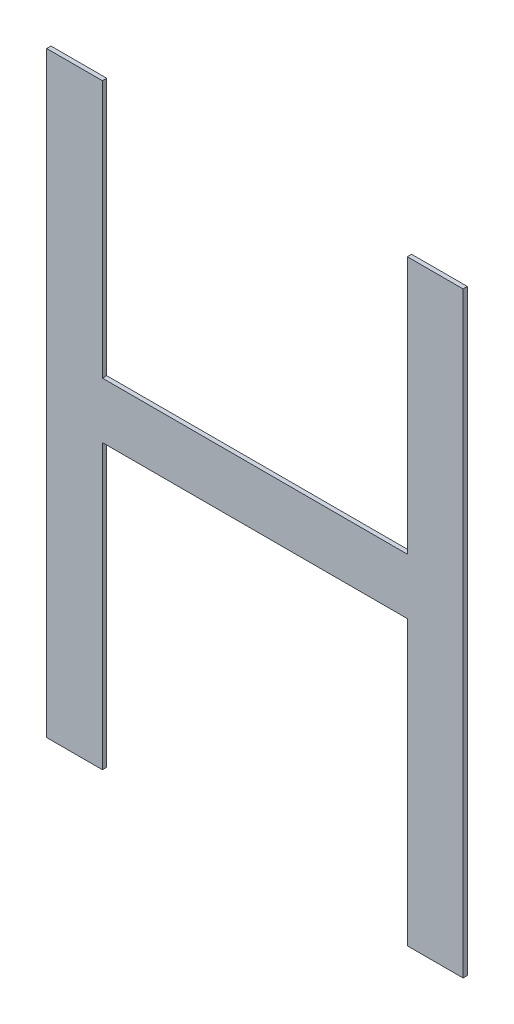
ISO-10303-21;
HEADER;
FILE_DESCRIPTION(('STEP AP214'),'2;1');
FILE_NAME('part.step','',(''),(''),'','','');
FILE_SCHEMA(('AUTOMOTIVE_DESIGN { 1 0 10303 214 1 1 1 1 }'));
ENDSEC;
DATA;
#1=APPLICATION_CONTEXT('core data for automotive mechanical design processes');
#2=APPLICATION_PROTOCOL_DEFINITION('international standard','automotive_design',2000,#1);
#3=PRODUCT_CONTEXT('',#1,'mechanical');
#4=PRODUCT('Part','Part','',(#3));
#5=PRODUCT_RELATED_PRODUCT_CATEGORY('part','',(#4));
#6=PRODUCT_DEFINITION_FORMATION('','',#4);
#7=PRODUCT_DEFINITION_CONTEXT('part definition',#1,'design');
#8=PRODUCT_DEFINITION('design','',#6,#7);
#9=PRODUCT_DEFINITION_SHAPE('','',#8);
#10=(LENGTH_UNIT() NAMED_UNIT(*) SI_UNIT(.MILLI.,.METRE.));
#11=(NAMED_UNIT(*) PLANE_ANGLE_UNIT() SI_UNIT($,.RADIAN.));
#12=(NAMED_UNIT(*) SI_UNIT($,.STERADIAN.) SOLID_ANGLE_UNIT());
#13=UNCERTAINTY_MEASURE_WITH_UNIT(LENGTH_MEASURE(1.E-05),#10,'distance_accuracy_value','');
#14=(GEOMETRIC_REPRESENTATION_CONTEXT(3) GLOBAL_UNCERTAINTY_ASSIGNED_CONTEXT((#13)) GLOBAL_UNIT_ASSIGNED_CONTEXT((#10,
#11,#12)) REPRESENTATION_CONTEXT('',''));
#15=CARTESIAN_POINT('',(0.,0.,0.));
#16=DIRECTION('',(0.,0.,1.));
#17=DIRECTION('',(1.,0.,0.));
#18=AXIS2_PLACEMENT_3D('',#15,#16,#17);
#19=CARTESIAN_POINT('',(-0.48499776,-0.69499988,0.01));
#20=DIRECTION('',(0.,0.,-1.));
#21=DIRECTION('',(-1.,0.,0.));
#22=AXIS2_PLACEMENT_3D('',#19,#20,#21);
#23=PLANE('',#22);
#24=DIRECTION('',(0.,1.,0.));
#25=VECTOR('',#24,1.);
#26=CARTESIAN_POINT('',(-0.35499802,-0.69499988,0.01));
#27=LINE('',#26,#25);
#28=CARTESIAN_POINT('',(-0.35499802,-0.03500120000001,0.01));
#29=VERTEX_POINT('',#28);
#30=CARTESIAN_POINT('',(-0.35499802,-0.69499988,0.01));
#31=VERTEX_POINT('',#30);
#32=EDGE_CURVE('E20',#29,#31,#27,.F.);
#33=ORIENTED_EDGE('',*,*,#32,.F.);
#34=DIRECTION('',(1.,0.,0.));
#35=VECTOR('',#34,1.);
#36=CARTESIAN_POINT('',(-0.35499802,-0.03500120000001,0.01));
#37=LINE('',#36,#35);
#38=CARTESIAN_POINT('',(0.35500056,-0.03500120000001,0.01));
#39=VERTEX_POINT('',#38);
#40=EDGE_CURVE('E154',#29,#39,#37,.T.);
#41=ORIENTED_EDGE('',*,*,#40,.T.);
#42=DIRECTION('',(0.,1.,0.));
#43=VECTOR('',#42,1.);
#44=CARTESIAN_POINT('',(0.35500056,-0.03500120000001,0.01));
#45=LINE('',#44,#43);
#46=CARTESIAN_POINT('',(0.35500056,-0.69499988,0.01));
#47=VERTEX_POINT('',#46);
#48=EDGE_CURVE('E150',#39,#47,#45,.F.);
#49=ORIENTED_EDGE('',*,*,#48,.T.);
#50=DIRECTION('',(1.,0.,0.));
#51=VECTOR('',#50,1.);
#52=CARTESIAN_POINT('',(0.35500056,-0.69499988,0.01));
#53=LINE('',#52,#51);
#54=CARTESIAN_POINT('',(0.4850003,-0.69499988,0.01));
#55=VERTEX_POINT('',#54);
#56=EDGE_CURVE('E146',#47,#55,#53,.T.);
#57=ORIENTED_EDGE('',*,*,#56,.T.);
#58=DIRECTION('',(0.,1.,0.));
#59=VECTOR('',#58,1.);
#60=CARTESIAN_POINT('',(0.4850003,-0.69499988,0.01));
#61=LINE('',#60,#59);
#62=CARTESIAN_POINT('',(0.4850003,0.69499988,0.01));
#63=VERTEX_POINT('',#62);
#64=EDGE_CURVE('E142',#55,#63,#61,.T.);
#65=ORIENTED_EDGE('',*,*,#64,.T.);
#66=DIRECTION('',(1.,0.,0.));
#67=VECTOR('',#66,1.);
#68=CARTESIAN_POINT('',(0.4850003,0.69499988,0.01));
#69=LINE('',#68,#67);
#70=CARTESIAN_POINT('',(0.35500056,0.69499988,0.01));
#71=VERTEX_POINT('',#70);
#72=EDGE_CURVE('E138',#63,#71,#69,.F.);
#73=ORIENTED_EDGE('',*,*,#72,.T.);
#74=DIRECTION('',(0.,1.,0.));
#75=VECTOR('',#74,1.);
#76=CARTESIAN_POINT('',(0.35500056,0.69499988,0.01));
#77=LINE('',#76,#75);
#78=CARTESIAN_POINT('',(0.35500056,0.09499853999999,0.01));
#79=VERTEX_POINT('',#78);
#80=EDGE_CURVE('E134',#71,#79,#77,.F.);
#81=ORIENTED_EDGE('',*,*,#80,.T.);
#82=DIRECTION('',(1.,0.,0.));
#83=VECTOR('',#82,1.);
#84=CARTESIAN_POINT('',(0.35500056,0.09499853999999,0.01));
#85=LINE('',#84,#83);
#86=CARTESIAN_POINT('',(-0.35499802,0.09499853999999,0.01));
#87=VERTEX_POINT('',#86);
#88=EDGE_CURVE('E130',#79,#87,#85,.F.);
#89=ORIENTED_EDGE('',*,*,#88,.T.);
#90=DIRECTION('',(0.,1.,0.));
#91=VECTOR('',#90,1.);
#92=CARTESIAN_POINT('',(-0.35499802,0.09499853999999,0.01));
#93=LINE('',#92,#91);
#94=CARTESIAN_POINT('',(-0.35499802,0.69499988,0.01));
#95=VERTEX_POINT('',#94);
#96=EDGE_CURVE('E126',#87,#95,#93,.T.);
#97=ORIENTED_EDGE('',*,*,#96,.T.);
#98=DIRECTION('',(1.,0.,0.));
#99=VECTOR('',#98,1.);
#100=CARTESIAN_POINT('',(-0.35499802,0.69499988,0.01));
#101=LINE('',#100,#99);
#102=CARTESIAN_POINT('',(-0.48499776,0.69499988,0.01));
#103=VERTEX_POINT('',#102);
#104=EDGE_CURVE('E104',#95,#103,#101,.F.);
#105=ORIENTED_EDGE('',*,*,#104,.T.);
#106=DIRECTION('',(0.,1.,0.));
#107=VECTOR('',#106,1.);
#108=CARTESIAN_POINT('',(-0.48499776,0.69499988,0.01));
#109=LINE('',#108,#107);
#110=CARTESIAN_POINT('',(-0.48499776,-0.69499988,0.01));
#111=VERTEX_POINT('',#110);
#112=EDGE_CURVE('E119',#103,#111,#109,.F.);
#113=ORIENTED_EDGE('',*,*,#112,.T.);
#114=DIRECTION('',(-1.,0.,0.));
#115=VECTOR('',#114,1.);
#116=CARTESIAN_POINT('',(-0.48499776,-0.69499988,0.01));
#117=LINE('',#116,#115);
#118=EDGE_CURVE('E111',#31,#111,#117,.T.);
#119=ORIENTED_EDGE('',*,*,#118,.F.);
#120=EDGE_LOOP('',(#33,#41,#49,#57,#65,#73,#81,#89,#97,#105,#113,#119));
#121=FACE_BOUND('',#120,.T.);
#122=ADVANCED_FACE('F17',(#121),#23,.F.);
#123=CARTESIAN_POINT('',(-0.48499776,0.69499988,0.));
#124=DIRECTION('',(1.,0.,0.));
#125=DIRECTION('',(0.,0.,-1.));
#126=AXIS2_PLACEMENT_3D('',#123,#124,#125);
#127=PLANE('',#126);
#128=DIRECTION('',(0.,0.,1.));
#129=VECTOR('',#128,1.);
#130=CARTESIAN_POINT('',(-0.48499776,-0.69499988,0.));
#131=LINE('',#130,#129);
#132=CARTESIAN_POINT('',(-0.48499776,-0.69499988,0.));
#133=VERTEX_POINT('',#132);
#134=EDGE_CURVE('E117',#133,#111,#131,.T.);
#135=ORIENTED_EDGE('',*,*,#134,.T.);
#136=ORIENTED_EDGE('',*,*,#112,.F.);
#137=DIRECTION('',(0.,0.,-1.));
#138=VECTOR('',#137,1.);
#139=CARTESIAN_POINT('',(-0.48499776,0.69499988,0.));
#140=LINE('',#139,#138);
#141=CARTESIAN_POINT('',(-0.48499776,0.69499988,0.));
#142=VERTEX_POINT('',#141);
#143=EDGE_CURVE('E124',#103,#142,#140,.T.);
#144=ORIENTED_EDGE('',*,*,#143,.T.);
#145=DIRECTION('',(0.,1.,0.));
#146=VECTOR('',#145,1.);
#147=CARTESIAN_POINT('',(-0.48499776,-0.69499988,0.));
#148=LINE('',#147,#146);
#149=EDGE_CURVE('E116',#133,#142,#148,.T.);
#150=ORIENTED_EDGE('',*,*,#149,.F.);
#151=EDGE_LOOP('',(#135,#136,#144,#150));
#152=FACE_BOUND('',#151,.T.);
#153=ADVANCED_FACE('F235',(#152),#127,.F.);
#154=CARTESIAN_POINT('',(-0.35499802,0.69499988,0.));
#155=DIRECTION('',(0.,-1.,0.));
#156=DIRECTION('',(0.,0.,-1.));
#157=AXIS2_PLACEMENT_3D('',#154,#155,#156);
#158=PLANE('',#157);
#159=ORIENTED_EDGE('',*,*,#143,.F.);
#160=ORIENTED_EDGE('',*,*,#104,.F.);
#161=DIRECTION('',(0.,0.,1.));
#162=VECTOR('',#161,1.);
#163=CARTESIAN_POINT('',(-0.35499802,0.69499988,0.));
#164=LINE('',#163,#162);
#165=CARTESIAN_POINT('',(-0.35499802,0.69499988,0.));
#166=VERTEX_POINT('',#165);
#167=EDGE_CURVE('E128',#95,#166,#164,.F.);
#168=ORIENTED_EDGE('',*,*,#167,.T.);
#169=DIRECTION('',(-1.,0.,0.));
#170=VECTOR('',#169,1.);
#171=CARTESIAN_POINT('',(-0.48499776,0.69499988,0.));
#172=LINE('',#171,#170);
#173=EDGE_CURVE('E162',#142,#166,#172,.F.);
#174=ORIENTED_EDGE('',*,*,#173,.F.);
#175=EDGE_LOOP('',(#159,#160,#168,#174));
#176=FACE_BOUND('',#175,.T.);
#177=ADVANCED_FACE('F233',(#176),#158,.F.);
#178=CARTESIAN_POINT('',(-0.35499802,0.09499853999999,0.));
#179=DIRECTION('',(-1.,0.,0.));
#180=DIRECTION('',(0.,0.,1.));
#181=AXIS2_PLACEMENT_3D('',#178,#179,#180);
#182=PLANE('',#181);
#183=ORIENTED_EDGE('',*,*,#167,.F.);
#184=ORIENTED_EDGE('',*,*,#96,.F.);
#185=DIRECTION('',(0.,0.,-1.));
#186=VECTOR('',#185,1.);
#187=CARTESIAN_POINT('',(-0.35499802,0.09499853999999,0.));
#188=LINE('',#187,#186);
#189=CARTESIAN_POINT('',(-0.35499802,0.09499853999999,0.));
#190=VERTEX_POINT('',#189);
#191=EDGE_CURVE('E132',#87,#190,#188,.T.);
#192=ORIENTED_EDGE('',*,*,#191,.T.);
#193=DIRECTION('',(0.,1.,0.));
#194=VECTOR('',#193,1.);
#195=CARTESIAN_POINT('',(-0.35499802,-0.69499988,0.));
#196=LINE('',#195,#194);
#197=EDGE_CURVE('E165',#166,#190,#196,.F.);
#198=ORIENTED_EDGE('',*,*,#197,.F.);
#199=EDGE_LOOP('',(#183,#184,#192,#198));
#200=FACE_BOUND('',#199,.T.);
#201=ADVANCED_FACE('F228',(#200),#182,.F.);
#202=CARTESIAN_POINT('',(0.35500056,0.09499853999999,0.));
#203=DIRECTION('',(0.,-1.,0.));
#204=DIRECTION('',(0.,0.,-1.));
#205=AXIS2_PLACEMENT_3D('',#202,#203,#204);
#206=PLANE('',#205);
#207=ORIENTED_EDGE('',*,*,#191,.F.);
#208=ORIENTED_EDGE('',*,*,#88,.F.);
#209=DIRECTION('',(0.,0.,-1.));
#210=VECTOR('',#209,1.);
#211=CARTESIAN_POINT('',(0.35500056,0.09499853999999,0.));
#212=LINE('',#211,#210);
#213=CARTESIAN_POINT('',(0.35500056,0.09499853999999,0.));
#214=VERTEX_POINT('',#213);
#215=EDGE_CURVE('E136',#79,#214,#212,.T.);
#216=ORIENTED_EDGE('',*,*,#215,.T.);
#217=DIRECTION('',(-1.,0.,0.));
#218=VECTOR('',#217,1.);
#219=CARTESIAN_POINT('',(-0.48499776,0.09499853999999,0.));
#220=LINE('',#219,#218);
#221=EDGE_CURVE('E168',#190,#214,#220,.F.);
#222=ORIENTED_EDGE('',*,*,#221,.F.);
#223=EDGE_LOOP('',(#207,#208,#216,#222));
#224=FACE_BOUND('',#223,.T.);
#225=ADVANCED_FACE('F224',(#224),#206,.F.);
#226=CARTESIAN_POINT('',(0.35500056,0.69499988,0.));
#227=DIRECTION('',(1.,0.,0.));
#228=DIRECTION('',(0.,0.,-1.));
#229=AXIS2_PLACEMENT_3D('',#226,#227,#228);
#230=PLANE('',#229);
#231=ORIENTED_EDGE('',*,*,#215,.F.);
#232=ORIENTED_EDGE('',*,*,#80,.F.);
#233=DIRECTION('',(0.,0.,-1.));
#234=VECTOR('',#233,1.);
#235=CARTESIAN_POINT('',(0.35500056,0.69499988,0.));
#236=LINE('',#235,#234);
#237=CARTESIAN_POINT('',(0.35500056,0.69499988,0.));
#238=VERTEX_POINT('',#237);
#239=EDGE_CURVE('E140',#71,#238,#236,.T.);
#240=ORIENTED_EDGE('',*,*,#239,.T.);
#241=DIRECTION('',(0.,1.,0.));
#242=VECTOR('',#241,1.);
#243=CARTESIAN_POINT('',(0.35500056,-0.69499988,0.));
#244=LINE('',#243,#242);
#245=EDGE_CURVE('E171',#214,#238,#244,.T.);
#246=ORIENTED_EDGE('',*,*,#245,.F.);
#247=EDGE_LOOP('',(#231,#232,#240,#246));
#248=FACE_BOUND('',#247,.T.);
#249=ADVANCED_FACE('F219',(#248),#230,.F.);
#250=CARTESIAN_POINT('',(0.4850003,0.69499988,0.));
#251=DIRECTION('',(0.,-1.,0.));
#252=DIRECTION('',(0.,0.,-1.));
#253=AXIS2_PLACEMENT_3D('',#250,#251,#252);
#254=PLANE('',#253);
#255=ORIENTED_EDGE('',*,*,#239,.F.);
#256=ORIENTED_EDGE('',*,*,#72,.F.);
#257=DIRECTION('',(0.,0.,1.));
#258=VECTOR('',#257,1.);
#259=CARTESIAN_POINT('',(0.4850003,0.69499988,0.));
#260=LINE('',#259,#258);
#261=CARTESIAN_POINT('',(0.4850003,0.69499988,0.));
#262=VERTEX_POINT('',#261);
#263=EDGE_CURVE('E144',#63,#262,#260,.F.);
#264=ORIENTED_EDGE('',*,*,#263,.T.);
#265=DIRECTION('',(-1.,0.,0.));
#266=VECTOR('',#265,1.);
#267=CARTESIAN_POINT('',(-0.48499776,0.69499988,0.));
#268=LINE('',#267,#266);
#269=EDGE_CURVE('E174',#238,#262,#268,.F.);
#270=ORIENTED_EDGE('',*,*,#269,.F.);
#271=EDGE_LOOP('',(#255,#256,#264,#270));
#272=FACE_BOUND('',#271,.T.);
#273=ADVANCED_FACE('F214',(#272),#254,.F.);
#274=CARTESIAN_POINT('',(0.4850003,-0.69499988,0.));
#275=DIRECTION('',(-1.,0.,0.));
#276=DIRECTION('',(0.,0.,1.));
#277=AXIS2_PLACEMENT_3D('',#274,#275,#276);
#278=PLANE('',#277);
#279=ORIENTED_EDGE('',*,*,#263,.F.);
#280=ORIENTED_EDGE('',*,*,#64,.F.);
#281=DIRECTION('',(0.,0.,1.));
#282=VECTOR('',#281,1.);
#283=CARTESIAN_POINT('',(0.4850003,-0.69499988,0.));
#284=LINE('',#283,#282);
#285=CARTESIAN_POINT('',(0.4850003,-0.69499988,0.));
#286=VERTEX_POINT('',#285);
#287=EDGE_CURVE('E148',#55,#286,#284,.F.);
#288=ORIENTED_EDGE('',*,*,#287,.T.);
#289=DIRECTION('',(0.,1.,0.));
#290=VECTOR('',#289,1.);
#291=CARTESIAN_POINT('',(0.4850003,-0.69499988,0.));
#292=LINE('',#291,#290);
#293=EDGE_CURVE('E177',#262,#286,#292,.F.);
#294=ORIENTED_EDGE('',*,*,#293,.F.);
#295=EDGE_LOOP('',(#279,#280,#288,#294));
#296=FACE_BOUND('',#295,.T.);
#297=ADVANCED_FACE('F209',(#296),#278,.F.);
#298=CARTESIAN_POINT('',(0.35500056,-0.69499988,0.));
#299=DIRECTION('',(0.,1.,0.));
#300=DIRECTION('',(0.,0.,1.));
#301=AXIS2_PLACEMENT_3D('',#298,#299,#300);
#302=PLANE('',#301);
#303=ORIENTED_EDGE('',*,*,#287,.F.);
#304=ORIENTED_EDGE('',*,*,#56,.F.);
#305=DIRECTION('',(0.,0.,-1.));
#306=VECTOR('',#305,1.);
#307=CARTESIAN_POINT('',(0.35500056,-0.69499988,0.));
#308=LINE('',#307,#306);
#309=CARTESIAN_POINT('',(0.35500056,-0.69499988,0.));
#310=VERTEX_POINT('',#309);
#311=EDGE_CURVE('E152',#47,#310,#308,.T.);
#312=ORIENTED_EDGE('',*,*,#311,.T.);
#313=DIRECTION('',(-1.,0.,0.));
#314=VECTOR('',#313,1.);
#315=CARTESIAN_POINT('',(-0.48499776,-0.69499988,0.));
#316=LINE('',#315,#314);
#317=EDGE_CURVE('E180',#286,#310,#316,.T.);
#318=ORIENTED_EDGE('',*,*,#317,.F.);
#319=EDGE_LOOP('',(#303,#304,#312,#318));
#320=FACE_BOUND('',#319,.T.);
#321=ADVANCED_FACE('F204',(#320),#302,.F.);
#322=CARTESIAN_POINT('',(0.35500056,-0.03500120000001,0.));
#323=DIRECTION('',(1.,0.,0.));
#324=DIRECTION('',(0.,0.,-1.));
#325=AXIS2_PLACEMENT_3D('',#322,#323,#324);
#326=PLANE('',#325);
#327=ORIENTED_EDGE('',*,*,#311,.F.);
#328=ORIENTED_EDGE('',*,*,#48,.F.);
#329=DIRECTION('',(0.,0.,1.));
#330=VECTOR('',#329,1.);
#331=CARTESIAN_POINT('',(0.35500056,-0.03500120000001,0.));
#332=LINE('',#331,#330);
#333=CARTESIAN_POINT('',(0.35500056,-0.03500120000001,0.));
#334=VERTEX_POINT('',#333);
#335=EDGE_CURVE('E156',#39,#334,#332,.F.);
#336=ORIENTED_EDGE('',*,*,#335,.T.);
#337=DIRECTION('',(0.,1.,0.));
#338=VECTOR('',#337,1.);
#339=CARTESIAN_POINT('',(0.35500056,-0.69499988,0.));
#340=LINE('',#339,#338);
#341=EDGE_CURVE('E183',#310,#334,#340,.T.);
#342=ORIENTED_EDGE('',*,*,#341,.F.);
#343=EDGE_LOOP('',(#327,#328,#336,#342));
#344=FACE_BOUND('',#343,.T.);
#345=ADVANCED_FACE('F200',(#344),#326,.F.);
#346=CARTESIAN_POINT('',(-0.35499802,-0.03500120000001,0.));
#347=DIRECTION('',(0.,1.,0.));
#348=DIRECTION('',(0.,0.,1.));
#349=AXIS2_PLACEMENT_3D('',#346,#347,#348);
#350=PLANE('',#349);
#351=ORIENTED_EDGE('',*,*,#335,.F.);
#352=ORIENTED_EDGE('',*,*,#40,.F.);
#353=DIRECTION('',(0.,0.,1.));
#354=VECTOR('',#353,1.);
#355=CARTESIAN_POINT('',(-0.35499802,-0.03500120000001,0.));
#356=LINE('',#355,#354);
#357=CARTESIAN_POINT('',(-0.35499802,-0.03500120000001,0.));
#358=VERTEX_POINT('',#357);
#359=EDGE_CURVE('E108',#29,#358,#356,.F.);
#360=ORIENTED_EDGE('',*,*,#359,.T.);
#361=DIRECTION('',(-1.,0.,0.));
#362=VECTOR('',#361,1.);
#363=CARTESIAN_POINT('',(-0.48499776,-0.03500120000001,0.));
#364=LINE('',#363,#362);
#365=EDGE_CURVE('E186',#334,#358,#364,.T.);
#366=ORIENTED_EDGE('',*,*,#365,.F.);
#367=EDGE_LOOP('',(#351,#352,#360,#366));
#368=FACE_BOUND('',#367,.T.);
#369=ADVANCED_FACE('F195',(#368),#350,.F.);
#370=CARTESIAN_POINT('',(-0.35499802,-0.69499988,0.));
#371=DIRECTION('',(-1.,0.,0.));
#372=DIRECTION('',(0.,0.,1.));
#373=AXIS2_PLACEMENT_3D('',#370,#371,#372);
#374=PLANE('',#373);
#375=ORIENTED_EDGE('',*,*,#359,.F.);
#376=ORIENTED_EDGE('',*,*,#32,.T.);
#377=DIRECTION('',(0.,0.,1.));
#378=VECTOR('',#377,1.);
#379=CARTESIAN_POINT('',(-0.35499802,-0.69499988,0.));
#380=LINE('',#379,#378);
#381=CARTESIAN_POINT('',(-0.35499802,-0.69499988,0.));
#382=VERTEX_POINT('',#381);
#383=EDGE_CURVE('E35',#31,#382,#380,.F.);
#384=ORIENTED_EDGE('',*,*,#383,.T.);
#385=DIRECTION('',(0.,1.,0.));
#386=VECTOR('',#385,1.);
#387=CARTESIAN_POINT('',(-0.35499802,-0.69499988,0.));
#388=LINE('',#387,#386);
#389=EDGE_CURVE('E26',#358,#382,#388,.F.);
#390=ORIENTED_EDGE('',*,*,#389,.F.);
#391=EDGE_LOOP('',(#375,#376,#384,#390));
#392=FACE_BOUND('',#391,.T.);
#393=ADVANCED_FACE('F107',(#392),#374,.F.);
#394=CARTESIAN_POINT('',(-0.48499776,-0.69499988,0.));
#395=DIRECTION('',(0.,1.,0.));
#396=DIRECTION('',(0.,0.,1.));
#397=AXIS2_PLACEMENT_3D('',#394,#395,#396);
#398=PLANE('',#397);
#399=ORIENTED_EDGE('',*,*,#383,.F.);
#400=ORIENTED_EDGE('',*,*,#118,.T.);
#401=ORIENTED_EDGE('',*,*,#134,.F.);
#402=DIRECTION('',(-1.,0.,0.));
#403=VECTOR('',#402,1.);
#404=CARTESIAN_POINT('',(-0.48499776,-0.69499988,0.));
#405=LINE('',#404,#403);
#406=EDGE_CURVE('E11',#382,#133,#405,.T.);
#407=ORIENTED_EDGE('',*,*,#406,.F.);
#408=EDGE_LOOP('',(#399,#400,#401,#407));
#409=FACE_BOUND('',#408,.T.);
#410=ADVANCED_FACE('F113',(#409),#398,.F.);
#411=CARTESIAN_POINT('',(-0.48499776,-0.69499988,0.));
#412=DIRECTION('',(0.,0.,-1.));
#413=DIRECTION('',(-1.,0.,0.));
#414=AXIS2_PLACEMENT_3D('',#411,#412,#413);
#415=PLANE('',#414);
#416=ORIENTED_EDGE('',*,*,#389,.T.);
#417=ORIENTED_EDGE('',*,*,#406,.T.);
#418=ORIENTED_EDGE('',*,*,#149,.T.);
#419=ORIENTED_EDGE('',*,*,#173,.T.);
#420=ORIENTED_EDGE('',*,*,#197,.T.);
#421=ORIENTED_EDGE('',*,*,#221,.T.);
#422=ORIENTED_EDGE('',*,*,#245,.T.);
#423=ORIENTED_EDGE('',*,*,#269,.T.);
#424=ORIENTED_EDGE('',*,*,#293,.T.);
#425=ORIENTED_EDGE('',*,*,#317,.T.);
#426=ORIENTED_EDGE('',*,*,#341,.T.);
#427=ORIENTED_EDGE('',*,*,#365,.T.);
#428=EDGE_LOOP('',(#416,#417,#418,#419,#420,#421,#422,#423,#424,#425,#426,#427));
#429=FACE_BOUND('',#428,.T.);
#430=ADVANCED_FACE('F190',(#429),#415,.T.);
#431=CLOSED_SHELL('',(#122,#153,#177,#201,#225,#249,#273,#297,#321,#345,#369,#393,#410,#430));
#432=MANIFOLD_SOLID_BREP('B1',#431);
#433=ADVANCED_BREP_SHAPE_REPRESENTATION('',(#18,#432),#14);
#434=SHAPE_DEFINITION_REPRESENTATION(#9,#433);
ENDSEC;
END-ISO-10303-21;
